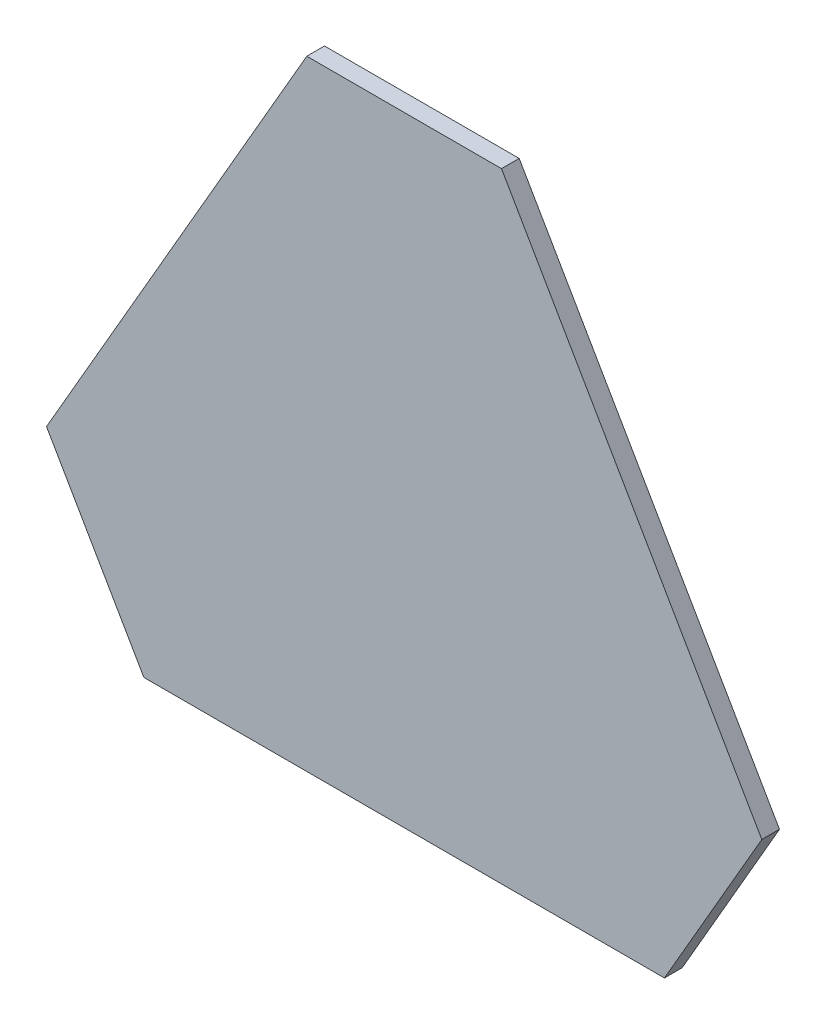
from build123d import *

# Parameters (mm, degrees)
BOSS_EXTRU_1_DEPTH = 10


with BuildPart() as part:
    # Esquisse1 → Boss.-Extru.1 (new body)
    with BuildSketch(Plane.XY):
        Polygon((-55, 201.579068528), (55, 201.579068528), (202.072594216, -53.158137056), (147.072594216, -148.420931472), (-147.072594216, -148.420931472), (-202.072594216, -53.158137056), align=None)
    extrude(amount=BOSS_EXTRU_1_DEPTH)


solid = part.part
